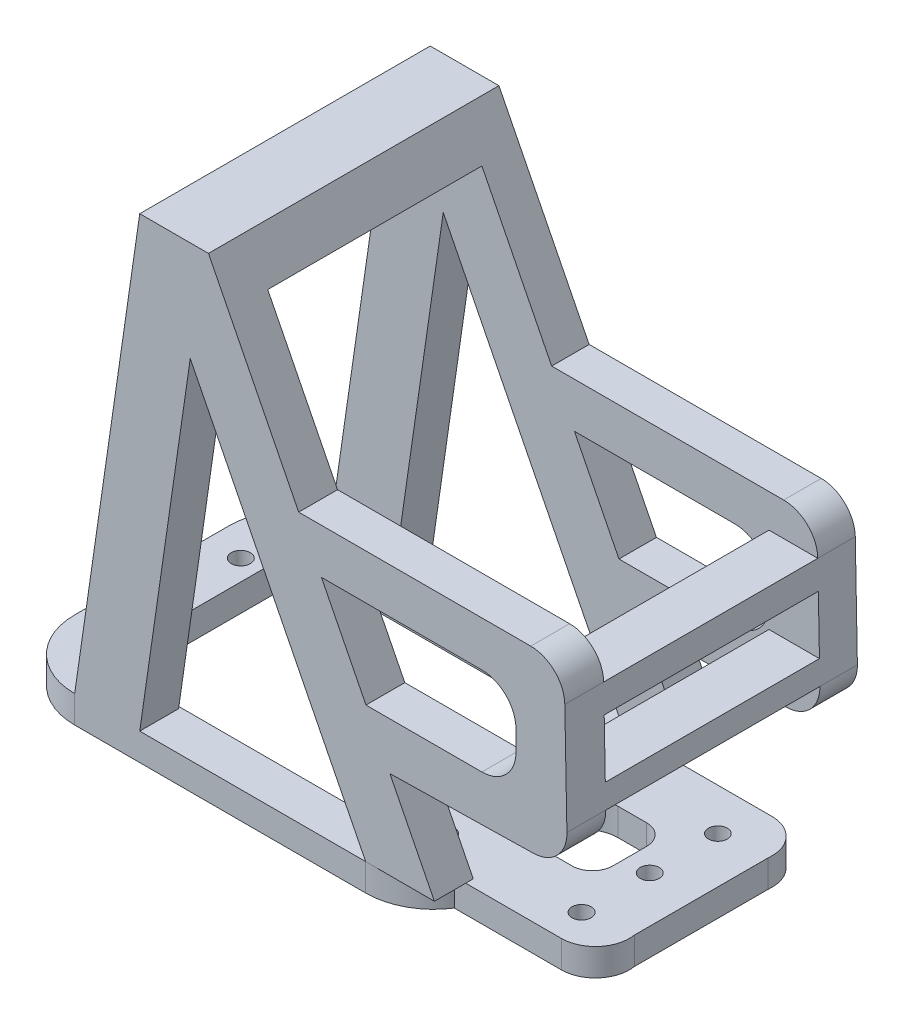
from build123d import *

# Parameters (mm, degrees)
SKETCH_1_R      = 1.4
SKETCH_1_R_2    = 1.397915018
SKETCH_1_R_3    = 1.382726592
SKETCH_1_R_4    = 1.388562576
SKETCH_1_R_5    = 1.391149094
SKETCH_1_R_6    = 1.388020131
SKETCH_1_R_7    = 1.396995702
SKETCH_1_R_8    = 1.403539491
EXTRUDE_1_DEPTH = 4
EXTRUDE_2_DEPTH = 5.7
EXTRUDE_START   = -5.5
EXTRUDE_4_DEPTH = 5.5
EXTRUDE_5_DEPTH = 34.5


with BuildPart() as part:
    # Sketch 1 → Extrude 1 (new body)
    with BuildSketch(Plane(origin=(0, 0, 0), x_dir=(1, 0, 0), z_dir=(0, 1, 0))):
        with BuildLine():
            Line((-10.370701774, 21.899048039), (31.668349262, 21.899048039))
            ThreePointArc((31.668349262, 21.899048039), (37.615106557, 19.938704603), (41.230326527, 14.826263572))
            Line((41.230326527, 14.826263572), (56.409187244, 14.826263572))
            ThreePointArc((56.409187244, 14.826263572), (60.135908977, 13.159662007), (61.378246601, 9.270881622))
            Line((61.378246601, 9.270881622), (61.378246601, -10.344633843))
            ThreePointArc((61.378246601, -10.344633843), (60.242209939, -14.374520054), (56.439926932, -16.127576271))
            Line((56.439926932, -16.127576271), (40.739945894, -16.127576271))
            ThreePointArc((40.739945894, -16.127576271), (37.119984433, -19.49746172), (32.327856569, -20.720474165))
            Line((32.327856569, -20.720474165), (-10.370701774, -20.720474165))
            ThreePointArc((-10.370701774, -20.720474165), (-17.441769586, -17.791541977), (-20.370701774, -10.720474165))
            Line((-20.370701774, -10.720474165), (-20.370701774, 11.899048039))
            ThreePointArc((-20.370701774, 11.899048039), (-17.441769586, 18.970115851), (-10.370701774, 21.899048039))
        make_face()
        with Locations(Location((-15.391979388, 8.672470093, 0), (0, 0, 270))):
            Circle(SKETCH_1_R, mode=Mode.SUBTRACT)
        with Locations(Location((-15.391979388, -1.327529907, 0), (0, 0, 270))):
            Circle(SKETCH_1_R_2, mode=Mode.SUBTRACT)
        with Locations(Location((-15.391979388, -11.327529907, 0), (0, 0, 270))):
            Circle(SKETCH_1_R_3, mode=Mode.SUBTRACT)
        with Locations(Location((34.608020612, 8.672470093, 0), (0, 0, 270))):
            Circle(SKETCH_1_R_4, mode=Mode.SUBTRACT)
        with Locations(Location((34.608020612, -11.327529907, 0), (0, 0, 270))):
            Circle(SKETCH_1_R_5, mode=Mode.SUBTRACT)
        with Locations(Location((54.608020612, 8.672470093, 0), (0, 0, 270))):
            Circle(SKETCH_1_R_6, mode=Mode.SUBTRACT)
        with Locations(Location((54.608020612, -1.327529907, 0), (0, 0, 270))):
            Circle(SKETCH_1_R_7, mode=Mode.SUBTRACT)
        with Locations(Location((54.608020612, -11.327529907, 0), (0, 0, 270))):
            Circle(SKETCH_1_R_8, mode=Mode.SUBTRACT)
        with BuildLine():
            Line((-7.370701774, 15.899048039), (23.866172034, 15.899048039))
            ThreePointArc((23.866172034, 15.899048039), (27.40170594, 14.434581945), (28.866172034, 10.899048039))
            Line((28.866172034, 10.899048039), (28.866172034, -9.720474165))
            ThreePointArc((28.866172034, -9.720474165), (27.40170594, -13.256008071), (23.866172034, -14.720474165))
            Line((23.866172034, -14.720474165), (-7.370701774, -14.720474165))
            ThreePointArc((-7.370701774, -14.720474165), (-10.90623568, -13.256008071), (-12.370701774, -9.720474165))
            Line((-12.370701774, -9.720474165), (-12.370701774, 10.899048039))
            ThreePointArc((-12.370701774, 10.899048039), (-10.90623568, 14.434581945), (-7.370701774, 15.899048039))
        make_face(mode=Mode.SUBTRACT)
        with BuildLine():
            Line((43.80010833, 4.826263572), (48.008020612, 4.826263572))
            ThreePointArc((48.008020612, 4.826263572), (50.129340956, 3.947583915), (51.008020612, 1.826263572))
            Line((51.008020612, 1.826263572), (51.008020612, -3.127576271))
            ThreePointArc((51.008020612, -3.127576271), (50.129340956, -5.248896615), (48.008020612, -6.127576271))
            Line((48.008020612, -6.127576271), (43.82795159, -6.127576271))
            ThreePointArc((43.82795159, -6.127576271), (40.34437993, -4.714319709), (38.830080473, -1.273467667))
            Line((38.830080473, -1.273467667), (38.802237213, -0.319627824))
            ThreePointArc((38.802237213, -0.319627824), (40.213364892, 3.309835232), (43.80010833, 4.826263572))
        make_face(mode=Mode.SUBTRACT)
    extrude(amount=EXTRUDE_1_DEPTH)

    # Sketch 5 → Extrude 2 (add)
    with BuildSketch(Plane.XY.offset(20.720474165)):
        with BuildLine():
            Line((-0.824912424, 69.749502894), (-10.370701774, 4))
            Line((-10.370701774, 4), (-0.824912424, 4))
            Line((-0.824912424, 4), (6.586797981, 55.050390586))
            Line((6.586797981, 55.050390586), (32.327856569, 4))
            Line((32.327856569, 4), (42.410552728, 4))
            Line((42.410552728, 4), (35.876016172, 16.959476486))
            Line((35.876016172, 16.959476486), (56.949176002, 17.361404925))
            ThreePointArc((56.949176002, 17.361404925), (60.456140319, 18.893025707), (61.852919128, 22.455843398))
            Line((61.852919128, 22.455843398), (61.545293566, 38.584691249))
            ThreePointArc((61.545293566, 38.584691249), (60.047863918, 42.058428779), (56.546202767, 43.489343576))
            Line((56.546202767, 43.489343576), (22.498902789, 43.489343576))
            Line((22.498902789, 43.489343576), (9.257783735, 69.749502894))
            Line((9.257783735, 69.749502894), (-0.824912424, 69.749502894))
        make_face()
        with BuildLine():
            Line((32.370900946, 23.910919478), (25.834168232, 36.874751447))
            Line((25.834168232, 36.874751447), (49.381312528, 36.874751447))
            ThreePointArc((49.381312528, 36.874751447), (52.916846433, 35.410285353), (54.381312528, 31.874751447))
            Line((54.381312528, 31.874751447), (54.381312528, 28.910919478))
            ThreePointArc((54.381312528, 28.910919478), (52.916846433, 25.375385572), (49.381312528, 23.910919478))
            Line((49.381312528, 23.910919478), (32.370900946, 23.910919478))
        make_face(mode=Mode.SUBTRACT)
    extrude(amount=-EXTRUDE_2_DEPTH)

    # Sketch 6 → Extrude 4 (add)
    with BuildSketch(Plane(origin=(0, 0, -21.899048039), x_dir=(-1, 0, 0), z_dir=(0, 0, -1)).offset(EXTRUDE_START)):
        Polygon((0.824912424, 4), (10.370701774, 4), (0.824912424, 69.749502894), (-9.257783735, 69.749502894), (-22.498902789, 43.489343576), (-25.834168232, 36.874751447), (-32.370900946, 23.910919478), (-35.876016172, 16.959476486), (-42.410552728, 4), (-32.327856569, 4), (-6.586797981, 55.050390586), align=None)
        with BuildLine():
            Line((-25.834168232, 36.874751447), (-22.498902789, 43.489343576))
            Line((-22.498902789, 43.489343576), (-56.546202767, 43.489343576))
            ThreePointArc((-56.546202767, 43.489343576), (-60.047863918, 42.058428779), (-61.545293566, 38.584691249))
            Line((-61.545293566, 38.584691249), (-61.852919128, 22.455843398))
            ThreePointArc((-61.852919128, 22.455843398), (-60.456140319, 18.893025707), (-56.949176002, 17.361404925))
            Line((-56.949176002, 17.361404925), (-35.876016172, 16.959476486))
            Line((-35.876016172, 16.959476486), (-32.370900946, 23.910919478))
            Line((-32.370900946, 23.910919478), (-49.381312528, 23.910919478))
            ThreePointArc((-49.381312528, 23.910919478), (-52.916846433, 25.375385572), (-54.381312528, 28.910919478))
            Line((-54.381312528, 28.910919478), (-54.381312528, 31.874751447))
            ThreePointArc((-54.381312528, 31.874751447), (-52.916846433, 35.410285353), (-49.381312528, 36.874751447))
            Line((-49.381312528, 36.874751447), (-25.834168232, 36.874751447))
        make_face()
    extrude(amount=EXTRUDE_4_DEPTH)

    # Sketch 7 → Extrude 5 (add)
    with BuildSketch(Plane.XY.offset(-16.399048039)):
        Polygon((-0.824912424, 69.749502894), (9.257783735, 69.749502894), (12.256849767, 63.801670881), (-1.688443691, 63.801670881), align=None)
        Polygon((61.545293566, 38.584691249), (54.381312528, 38.584691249), (54.381312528, 34.433473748), (61.624469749, 34.433473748), align=None)
        Polygon((61.852919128, 22.455843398), (54.381312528, 22.455843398), (54.381312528, 25.96102946), (61.786064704, 25.96102946), align=None)
    extrude(amount=EXTRUDE_5_DEPTH)


solid = part.part
